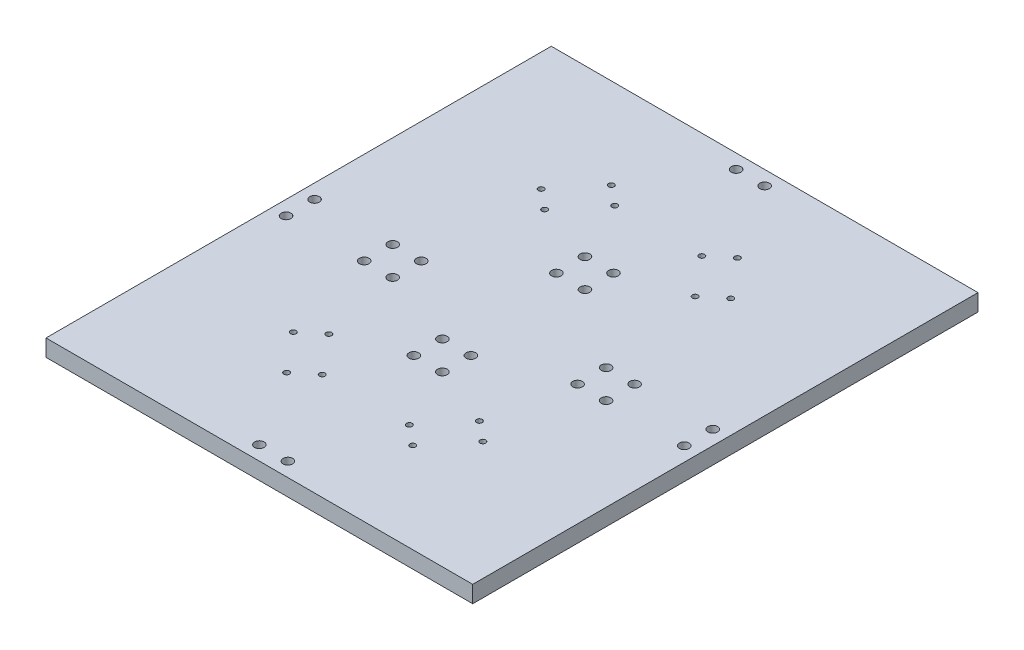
ISO-10303-21;
HEADER;
FILE_DESCRIPTION(('STEP AP214'),'2;1');
FILE_NAME('part.step','',(''),(''),'','','');
FILE_SCHEMA(('AUTOMOTIVE_DESIGN { 1 0 10303 214 1 1 1 1 }'));
ENDSEC;
DATA;
#1=APPLICATION_CONTEXT('core data for automotive mechanical design processes');
#2=APPLICATION_PROTOCOL_DEFINITION('international standard','automotive_design',2000,#1);
#3=PRODUCT_CONTEXT('',#1,'mechanical');
#4=PRODUCT('Part','Part','',(#3));
#5=PRODUCT_RELATED_PRODUCT_CATEGORY('part','',(#4));
#6=PRODUCT_DEFINITION_FORMATION('','',#4);
#7=PRODUCT_DEFINITION_CONTEXT('part definition',#1,'design');
#8=PRODUCT_DEFINITION('design','',#6,#7);
#9=PRODUCT_DEFINITION_SHAPE('','',#8);
#10=(LENGTH_UNIT() NAMED_UNIT(*) SI_UNIT(.MILLI.,.METRE.));
#11=(NAMED_UNIT(*) PLANE_ANGLE_UNIT() SI_UNIT($,.RADIAN.));
#12=(NAMED_UNIT(*) SI_UNIT($,.STERADIAN.) SOLID_ANGLE_UNIT());
#13=UNCERTAINTY_MEASURE_WITH_UNIT(LENGTH_MEASURE(1.E-05),#10,'distance_accuracy_value','');
#14=(GEOMETRIC_REPRESENTATION_CONTEXT(3) GLOBAL_UNCERTAINTY_ASSIGNED_CONTEXT((#13)) GLOBAL_UNIT_ASSIGNED_CONTEXT((#10,
#11,#12)) REPRESENTATION_CONTEXT('',''));
#15=CARTESIAN_POINT('',(0.,0.,0.));
#16=DIRECTION('',(0.,0.,1.));
#17=DIRECTION('',(1.,0.,0.));
#18=AXIS2_PLACEMENT_3D('',#15,#16,#17);
#19=CARTESIAN_POINT('',(0.,12.,0.));
#20=DIRECTION('',(0.,1.,0.));
#21=DIRECTION('',(0.,0.,1.));
#22=AXIS2_PLACEMENT_3D('',#19,#20,#21);
#23=PLANE('',#22);
#24=CARTESIAN_POINT('',(10.16,12.,39.456));
#25=DIRECTION('',(0.,1.,0.));
#26=DIRECTION('',(0.,0.,-1.));
#27=AXIS2_PLACEMENT_3D('',#24,#25,#26);
#28=CIRCLE('',#27,3.429);
#29=CARTESIAN_POINT('',(10.16,12.,36.027));
#30=VERTEX_POINT('',#29);
#31=EDGE_CURVE('E417',#30,#30,#28,.T.);
#32=ORIENTED_EDGE('',*,*,#31,.F.);
#33=EDGE_LOOP('',(#32));
#34=FACE_BOUND('',#33,.T.);
#35=CARTESIAN_POINT('',(-10.16,12.,-41.824));
#36=DIRECTION('',(0.,1.,0.));
#37=DIRECTION('',(0.,0.,1.));
#38=AXIS2_PLACEMENT_3D('',#35,#36,#37);
#39=CIRCLE('',#38,3.429);
#40=CARTESIAN_POINT('',(-10.16,12.,-38.395));
#41=VERTEX_POINT('',#40);
#42=EDGE_CURVE('E410',#41,#41,#39,.T.);
#43=ORIENTED_EDGE('',*,*,#42,.F.);
#44=EDGE_LOOP('',(#43));
#45=FACE_BOUND('',#44,.T.);
#46=CARTESIAN_POINT('',(10.16,12.,-41.824));
#47=DIRECTION('',(0.,1.,0.));
#48=DIRECTION('',(0.,0.,1.));
#49=AXIS2_PLACEMENT_3D('',#46,#47,#48);
#50=CIRCLE('',#49,3.429);
#51=CARTESIAN_POINT('',(10.16,12.,-38.395));
#52=VERTEX_POINT('',#51);
#53=EDGE_CURVE('E401',#52,#52,#50,.T.);
#54=ORIENTED_EDGE('',*,*,#53,.F.);
#55=EDGE_LOOP('',(#54));
#56=FACE_BOUND('',#55,.T.);
#57=CARTESIAN_POINT('',(10.16,12.,-62.144));
#58=DIRECTION('',(0.,1.,0.));
#59=DIRECTION('',(0.,0.,1.));
#60=AXIS2_PLACEMENT_3D('',#57,#58,#59);
#61=CIRCLE('',#60,3.429);
#62=CARTESIAN_POINT('',(10.16,12.,-58.715));
#63=VERTEX_POINT('',#62);
#64=EDGE_CURVE('E400',#63,#63,#61,.T.);
#65=ORIENTED_EDGE('',*,*,#64,.F.);
#66=EDGE_LOOP('',(#65));
#67=FACE_BOUND('',#66,.T.);
#68=CARTESIAN_POINT('',(-10.16,12.,59.776));
#69=DIRECTION('',(0.,1.,0.));
#70=DIRECTION('',(0.,0.,-1.));
#71=AXIS2_PLACEMENT_3D('',#68,#69,#70);
#72=CIRCLE('',#71,3.429);
#73=CARTESIAN_POINT('',(-10.16,12.,56.347));
#74=VERTEX_POINT('',#73);
#75=EDGE_CURVE('E442',#74,#74,#72,.T.);
#76=ORIENTED_EDGE('',*,*,#75,.F.);
#77=EDGE_LOOP('',(#76));
#78=FACE_BOUND('',#77,.T.);
#79=CARTESIAN_POINT('',(10.16,12.,59.776));
#80=DIRECTION('',(0.,1.,0.));
#81=DIRECTION('',(0.,0.,-1.));
#82=AXIS2_PLACEMENT_3D('',#79,#80,#81);
#83=CIRCLE('',#82,3.429);
#84=CARTESIAN_POINT('',(10.16,12.,56.347));
#85=VERTEX_POINT('',#84);
#86=EDGE_CURVE('E433',#85,#85,#83,.T.);
#87=ORIENTED_EDGE('',*,*,#86,.F.);
#88=EDGE_LOOP('',(#87));
#89=FACE_BOUND('',#88,.T.);
#90=CARTESIAN_POINT('',(-10.16,12.,39.456));
#91=DIRECTION('',(0.,1.,0.));
#92=DIRECTION('',(0.,0.,-1.));
#93=AXIS2_PLACEMENT_3D('',#90,#91,#92);
#94=CIRCLE('',#93,3.429);
#95=CARTESIAN_POINT('',(-10.16,12.,36.027));
#96=VERTEX_POINT('',#95);
#97=EDGE_CURVE('E426',#96,#96,#94,.T.);
#98=ORIENTED_EDGE('',*,*,#97,.F.);
#99=EDGE_LOOP('',(#98));
#100=FACE_BOUND('',#99,.T.);
#101=CARTESIAN_POINT('',(-10.16,12.,-62.144));
#102=DIRECTION('',(0.,1.,0.));
#103=DIRECTION('',(0.,0.,1.));
#104=AXIS2_PLACEMENT_3D('',#101,#102,#103);
#105=CIRCLE('',#104,3.429);
#106=CARTESIAN_POINT('',(-10.16,12.,-58.715));
#107=VERTEX_POINT('',#106);
#108=EDGE_CURVE('E396',#107,#107,#105,.T.);
#109=ORIENTED_EDGE('',*,*,#108,.F.);
#110=EDGE_LOOP('',(#109));
#111=FACE_BOUND('',#110,.T.);
#112=CARTESIAN_POINT('',(-10.16,12.,169.84));
#113=DIRECTION('',(0.,1.,0.));
#114=DIRECTION('',(0.,0.,-1.));
#115=AXIS2_PLACEMENT_3D('',#112,#113,#114);
#116=CIRCLE('',#115,3.42899999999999);
#117=CARTESIAN_POINT('',(-10.16,12.,166.411));
#118=VERTEX_POINT('',#117);
#119=EDGE_CURVE('E369',#118,#118,#116,.T.);
#120=ORIENTED_EDGE('',*,*,#119,.F.);
#121=EDGE_LOOP('',(#120));
#122=FACE_BOUND('',#121,.T.);
#123=CARTESIAN_POINT('',(10.16,12.,169.84));
#124=DIRECTION('',(0.,1.,0.));
#125=DIRECTION('',(0.,0.,-1.));
#126=AXIS2_PLACEMENT_3D('',#123,#124,#125);
#127=CIRCLE('',#126,3.42899999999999);
#128=CARTESIAN_POINT('',(10.16,12.,166.411));
#129=VERTEX_POINT('',#128);
#130=EDGE_CURVE('E379',#129,#129,#127,.T.);
#131=ORIENTED_EDGE('',*,*,#130,.F.);
#132=EDGE_LOOP('',(#131));
#133=FACE_BOUND('',#132,.T.);
#134=CARTESIAN_POINT('',(10.16,12.,-169.84));
#135=DIRECTION('',(0.,1.,0.));
#136=DIRECTION('',(0.,0.,1.));
#137=AXIS2_PLACEMENT_3D('',#134,#135,#136);
#138=CIRCLE('',#137,3.42899999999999);
#139=CARTESIAN_POINT('',(10.16,12.,-166.411));
#140=VERTEX_POINT('',#139);
#141=EDGE_CURVE('E368',#140,#140,#138,.T.);
#142=ORIENTED_EDGE('',*,*,#141,.F.);
#143=EDGE_LOOP('',(#142));
#144=FACE_BOUND('',#143,.T.);
#145=CARTESIAN_POINT('',(-10.16,12.,-169.84));
#146=DIRECTION('',(0.,1.,0.));
#147=DIRECTION('',(0.,0.,1.));
#148=AXIS2_PLACEMENT_3D('',#145,#146,#147);
#149=CIRCLE('',#148,3.42899999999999);
#150=CARTESIAN_POINT('',(-10.16,12.,-166.411));
#151=VERTEX_POINT('',#150);
#152=EDGE_CURVE('E364',#151,#151,#149,.T.);
#153=ORIENTED_EDGE('',*,*,#152,.F.);
#154=EDGE_LOOP('',(#153));
#155=FACE_BOUND('',#154,.T.);
#156=CARTESIAN_POINT('',(-141.859,12.,-1.18399999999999));
#157=DIRECTION('',(0.,1.,0.));
#158=DIRECTION('',(0.,0.,1.));
#159=AXIS2_PLACEMENT_3D('',#156,#157,#158);
#160=CIRCLE('',#159,3.429);
#161=CARTESIAN_POINT('',(-141.859,12.,2.24500000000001));
#162=VERTEX_POINT('',#161);
#163=EDGE_CURVE('E336',#162,#162,#160,.T.);
#164=ORIENTED_EDGE('',*,*,#163,.F.);
#165=EDGE_LOOP('',(#164));
#166=FACE_BOUND('',#165,.T.);
#167=CARTESIAN_POINT('',(141.859,12.,19.136));
#168=DIRECTION('',(0.,1.,0.));
#169=DIRECTION('',(0.,0.,-1.));
#170=AXIS2_PLACEMENT_3D('',#167,#168,#169);
#171=CIRCLE('',#170,3.429);
#172=CARTESIAN_POINT('',(141.859,12.,15.707));
#173=VERTEX_POINT('',#172);
#174=EDGE_CURVE('E337',#173,#173,#171,.T.);
#175=ORIENTED_EDGE('',*,*,#174,.F.);
#176=EDGE_LOOP('',(#175));
#177=FACE_BOUND('',#176,.T.);
#178=CARTESIAN_POINT('',(141.859,12.,-1.18399999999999));
#179=DIRECTION('',(0.,1.,0.));
#180=DIRECTION('',(0.,0.,-1.));
#181=AXIS2_PLACEMENT_3D('',#178,#179,#180);
#182=CIRCLE('',#181,3.429);
#183=CARTESIAN_POINT('',(141.859,12.,-4.61299999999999));
#184=VERTEX_POINT('',#183);
#185=EDGE_CURVE('E346',#184,#184,#182,.T.);
#186=ORIENTED_EDGE('',*,*,#185,.F.);
#187=EDGE_LOOP('',(#186));
#188=FACE_BOUND('',#187,.T.);
#189=CARTESIAN_POINT('',(-141.859,12.,19.136));
#190=DIRECTION('',(0.,1.,0.));
#191=DIRECTION('',(0.,0.,1.));
#192=AXIS2_PLACEMENT_3D('',#189,#190,#191);
#193=CIRCLE('',#192,3.429);
#194=CARTESIAN_POINT('',(-141.859,12.,22.565));
#195=VERTEX_POINT('',#194);
#196=EDGE_CURVE('E332',#195,#195,#193,.T.);
#197=ORIENTED_EDGE('',*,*,#196,.F.);
#198=EDGE_LOOP('',(#197));
#199=FACE_BOUND('',#198,.T.);
#200=CARTESIAN_POINT('',(65.8495,12.,-1.18399999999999));
#201=DIRECTION('',(0.,1.,0.));
#202=DIRECTION('',(0.,0.,-1.));
#203=AXIS2_PLACEMENT_3D('',#200,#201,#202);
#204=CIRCLE('',#203,3.429);
#205=CARTESIAN_POINT('',(65.8495,12.,-4.61299999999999));
#206=VERTEX_POINT('',#205);
#207=EDGE_CURVE('E289',#206,#206,#204,.T.);
#208=ORIENTED_EDGE('',*,*,#207,.F.);
#209=EDGE_LOOP('',(#208));
#210=FACE_BOUND('',#209,.T.);
#211=CARTESIAN_POINT('',(-65.8495,12.,19.136));
#212=DIRECTION('',(0.,1.,0.));
#213=DIRECTION('',(0.,0.,1.));
#214=AXIS2_PLACEMENT_3D('',#211,#212,#213);
#215=CIRCLE('',#214,3.429);
#216=CARTESIAN_POINT('',(-65.8495,12.,22.565));
#217=VERTEX_POINT('',#216);
#218=EDGE_CURVE('E282',#217,#217,#215,.T.);
#219=ORIENTED_EDGE('',*,*,#218,.F.);
#220=EDGE_LOOP('',(#219));
#221=FACE_BOUND('',#220,.T.);
#222=CARTESIAN_POINT('',(-86.1695,12.,19.136));
#223=DIRECTION('',(0.,1.,0.));
#224=DIRECTION('',(0.,0.,1.));
#225=AXIS2_PLACEMENT_3D('',#222,#223,#224);
#226=CIRCLE('',#225,3.429);
#227=CARTESIAN_POINT('',(-86.1695,12.,22.565));
#228=VERTEX_POINT('',#227);
#229=EDGE_CURVE('E273',#228,#228,#226,.T.);
#230=ORIENTED_EDGE('',*,*,#229,.F.);
#231=EDGE_LOOP('',(#230));
#232=FACE_BOUND('',#231,.T.);
#233=CARTESIAN_POINT('',(-65.8495,12.,-1.18399999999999));
#234=DIRECTION('',(0.,1.,0.));
#235=DIRECTION('',(0.,0.,1.));
#236=AXIS2_PLACEMENT_3D('',#233,#234,#235);
#237=CIRCLE('',#236,3.429);
#238=CARTESIAN_POINT('',(-65.8495,12.,2.24500000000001));
#239=VERTEX_POINT('',#238);
#240=EDGE_CURVE('E272',#239,#239,#237,.T.);
#241=ORIENTED_EDGE('',*,*,#240,.F.);
#242=EDGE_LOOP('',(#241));
#243=FACE_BOUND('',#242,.T.);
#244=CARTESIAN_POINT('',(65.8495,12.,19.136));
#245=DIRECTION('',(0.,1.,0.));
#246=DIRECTION('',(0.,0.,-1.));
#247=AXIS2_PLACEMENT_3D('',#244,#245,#246);
#248=CIRCLE('',#247,3.429);
#249=CARTESIAN_POINT('',(65.8495,12.,15.707));
#250=VERTEX_POINT('',#249);
#251=EDGE_CURVE('E298',#250,#250,#248,.T.);
#252=ORIENTED_EDGE('',*,*,#251,.F.);
#253=EDGE_LOOP('',(#252));
#254=FACE_BOUND('',#253,.T.);
#255=CARTESIAN_POINT('',(86.1695,12.,19.136));
#256=DIRECTION('',(0.,1.,0.));
#257=DIRECTION('',(0.,0.,-1.));
#258=AXIS2_PLACEMENT_3D('',#255,#256,#257);
#259=CIRCLE('',#258,3.429);
#260=CARTESIAN_POINT('',(86.1695,12.,15.707));
#261=VERTEX_POINT('',#260);
#262=EDGE_CURVE('E315',#261,#261,#259,.T.);
#263=ORIENTED_EDGE('',*,*,#262,.F.);
#264=EDGE_LOOP('',(#263));
#265=FACE_BOUND('',#264,.T.);
#266=CARTESIAN_POINT('',(86.1695,12.,-1.18399999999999));
#267=DIRECTION('',(0.,1.,0.));
#268=DIRECTION('',(0.,0.,-1.));
#269=AXIS2_PLACEMENT_3D('',#266,#267,#268);
#270=CIRCLE('',#269,3.429);
#271=CARTESIAN_POINT('',(86.1695,12.,-4.61299999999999));
#272=VERTEX_POINT('',#271);
#273=EDGE_CURVE('E305',#272,#272,#270,.T.);
#274=ORIENTED_EDGE('',*,*,#273,.F.);
#275=EDGE_LOOP('',(#274));
#276=FACE_BOUND('',#275,.T.);
#277=CARTESIAN_POINT('',(-86.1695,12.,-1.18399999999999));
#278=DIRECTION('',(0.,1.,0.));
#279=DIRECTION('',(0.,0.,1.));
#280=AXIS2_PLACEMENT_3D('',#277,#278,#279);
#281=CIRCLE('',#280,3.429);
#282=CARTESIAN_POINT('',(-86.1695,12.,2.24500000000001));
#283=VERTEX_POINT('',#282);
#284=EDGE_CURVE('E268',#283,#283,#281,.T.);
#285=ORIENTED_EDGE('',*,*,#284,.F.);
#286=EDGE_LOOP('',(#285));
#287=FACE_BOUND('',#286,.T.);
#288=CARTESIAN_POINT('',(31.0360206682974,12.,-104.2003199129));
#289=DIRECTION('',(0.,-1.,0.));
#290=DIRECTION('',(0.,0.,-1.));
#291=AXIS2_PLACEMENT_3D('',#288,#289,#290);
#292=CIRCLE('',#291,1.99999999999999);
#293=CARTESIAN_POINT('',(31.0360206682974,12.,-106.2003199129));
#294=VERTEX_POINT('',#293);
#295=EDGE_CURVE('E202',#294,#294,#292,.T.);
#296=ORIENTED_EDGE('',*,*,#295,.T.);
#297=EDGE_LOOP('',(#296));
#298=FACE_BOUND('',#297,.T.);
#299=CARTESIAN_POINT('',(44.9153772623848,12.,-115.661709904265));
#300=DIRECTION('',(0.,-1.,0.));
#301=DIRECTION('',(0.,0.,-1.));
#302=AXIS2_PLACEMENT_3D('',#299,#300,#301);
#303=CIRCLE('',#302,1.99999999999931);
#304=CARTESIAN_POINT('',(44.9153772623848,12.,-117.661709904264));
#305=VERTEX_POINT('',#304);
#306=EDGE_CURVE('E191',#305,#305,#303,.T.);
#307=ORIENTED_EDGE('',*,*,#306,.T.);
#308=EDGE_LOOP('',(#307));
#309=FACE_BOUND('',#308,.T.);
#310=CARTESIAN_POINT('',(53.6404261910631,12.,76.8271423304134));
#311=DIRECTION('',(0.,-1.,0.));
#312=DIRECTION('',(0.,0.,-1.));
#313=AXIS2_PLACEMENT_3D('',#310,#311,#312);
#314=CIRCLE('',#313,1.99999999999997);
#315=CARTESIAN_POINT('',(53.6404261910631,12.,74.8271423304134));
#316=VERTEX_POINT('',#315);
#317=EDGE_CURVE('E163',#316,#316,#314,.T.);
#318=ORIENTED_EDGE('',*,*,#317,.T.);
#319=EDGE_LOOP('',(#318));
#320=FACE_BOUND('',#319,.T.);
#321=CARTESIAN_POINT('',(67.5197827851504,12.,88.2885323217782));
#322=DIRECTION('',(0.,-1.,0.));
#323=DIRECTION('',(0.,0.,-1.));
#324=AXIS2_PLACEMENT_3D('',#321,#322,#323);
#325=CIRCLE('',#324,2.00000000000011);
#326=CARTESIAN_POINT('',(67.5197827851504,12.,86.2885323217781));
#327=VERTEX_POINT('',#326);
#328=EDGE_CURVE('E145',#327,#327,#325,.T.);
#329=ORIENTED_EDGE('',*,*,#328,.T.);
#330=EDGE_LOOP('',(#329));
#331=FACE_BOUND('',#330,.T.);
#332=CARTESIAN_POINT('',(-31.0360206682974,12.,104.2003199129));
#333=DIRECTION('',(0.,-1.,0.));
#334=DIRECTION('',(0.,0.,-1.));
#335=AXIS2_PLACEMENT_3D('',#332,#333,#334);
#336=CIRCLE('',#335,1.99999999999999);
#337=CARTESIAN_POINT('',(-31.0360206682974,12.,102.2003199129));
#338=VERTEX_POINT('',#337);
#339=EDGE_CURVE('E241',#338,#338,#336,.T.);
#340=ORIENTED_EDGE('',*,*,#339,.T.);
#341=EDGE_LOOP('',(#340));
#342=FACE_BOUND('',#341,.T.);
#343=CARTESIAN_POINT('',(-44.9153772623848,12.,115.661709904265));
#344=DIRECTION('',(0.,-1.,0.));
#345=DIRECTION('',(0.,0.,-1.));
#346=AXIS2_PLACEMENT_3D('',#343,#344,#345);
#347=CIRCLE('',#346,1.99999999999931);
#348=CARTESIAN_POINT('',(-44.9153772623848,12.,113.661709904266));
#349=VERTEX_POINT('',#348);
#350=EDGE_CURVE('E250',#349,#349,#347,.T.);
#351=ORIENTED_EDGE('',*,*,#350,.T.);
#352=EDGE_LOOP('',(#351));
#353=FACE_BOUND('',#352,.T.);
#354=CARTESIAN_POINT('',(-67.5197827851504,12.,-88.2885323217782));
#355=DIRECTION('',(0.,-1.,0.));
#356=DIRECTION('',(0.,0.,-1.));
#357=AXIS2_PLACEMENT_3D('',#354,#355,#356);
#358=CIRCLE('',#357,2.00000000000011);
#359=CARTESIAN_POINT('',(-67.5197827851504,12.,-90.2885323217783));
#360=VERTEX_POINT('',#359);
#361=EDGE_CURVE('E209',#360,#360,#358,.T.);
#362=ORIENTED_EDGE('',*,*,#361,.T.);
#363=EDGE_LOOP('',(#362));
#364=FACE_BOUND('',#363,.T.);
#365=CARTESIAN_POINT('',(-53.6404261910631,12.,-76.8271423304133));
#366=DIRECTION('',(0.,-1.,0.));
#367=DIRECTION('',(0.,0.,-1.));
#368=AXIS2_PLACEMENT_3D('',#365,#366,#367);
#369=CIRCLE('',#368,1.99999999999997);
#370=CARTESIAN_POINT('',(-53.6404261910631,12.,-78.8271423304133));
#371=VERTEX_POINT('',#370);
#372=EDGE_CURVE('E119',#371,#371,#369,.T.);
#373=ORIENTED_EDGE('',*,*,#372,.T.);
#374=EDGE_LOOP('',(#373));
#375=FACE_BOUND('',#374,.T.);
#376=DIRECTION('',(0.,0.,-1.));
#377=VECTOR('',#376,1.);
#378=CARTESIAN_POINT('',(152.019,12.,-180.));
#379=LINE('',#378,#377);
#380=CARTESIAN_POINT('',(152.019,12.,180.));
#381=VERTEX_POINT('',#380);
#382=CARTESIAN_POINT('',(152.019,12.,-180.));
#383=VERTEX_POINT('',#382);
#384=EDGE_CURVE('E97',#381,#383,#379,.T.);
#385=ORIENTED_EDGE('',*,*,#384,.T.);
#386=DIRECTION('',(-1.,0.,0.));
#387=VECTOR('',#386,1.);
#388=CARTESIAN_POINT('',(112.019,12.,-180.));
#389=LINE('',#388,#387);
#390=CARTESIAN_POINT('',(-152.019,12.,-180.));
#391=VERTEX_POINT('',#390);
#392=EDGE_CURVE('E92',#383,#391,#389,.T.);
#393=ORIENTED_EDGE('',*,*,#392,.T.);
#394=DIRECTION('',(0.,0.,1.));
#395=VECTOR('',#394,1.);
#396=CARTESIAN_POINT('',(-152.019,12.,-180.));
#397=LINE('',#396,#395);
#398=CARTESIAN_POINT('',(-152.019,12.,180.));
#399=VERTEX_POINT('',#398);
#400=EDGE_CURVE('E95',#391,#399,#397,.T.);
#401=ORIENTED_EDGE('',*,*,#400,.T.);
#402=DIRECTION('',(1.,0.,0.));
#403=VECTOR('',#402,1.);
#404=CARTESIAN_POINT('',(-152.019,12.,180.));
#405=LINE('',#404,#403);
#406=EDGE_CURVE('E66',#399,#381,#405,.T.);
#407=ORIENTED_EDGE('',*,*,#406,.T.);
#408=EDGE_LOOP('',(#385,#393,#401,#407));
#409=FACE_BOUND('',#408,.T.);
#410=CARTESIAN_POINT('',(44.9153772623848,12.,115.661709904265));
#411=DIRECTION('',(0.,1.,0.));
#412=DIRECTION('',(0.,0.,1.));
#413=AXIS2_PLACEMENT_3D('',#410,#411,#412);
#414=CIRCLE('',#413,1.99999999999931);
#415=CARTESIAN_POINT('',(44.9153772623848,12.,117.661709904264));
#416=VERTEX_POINT('',#415);
#417=EDGE_CURVE('E168',#416,#416,#414,.T.);
#418=ORIENTED_EDGE('',*,*,#417,.F.);
#419=EDGE_LOOP('',(#418));
#420=FACE_BOUND('',#419,.T.);
#421=CARTESIAN_POINT('',(-31.0360206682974,12.,-104.2003199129));
#422=DIRECTION('',(0.,1.,0.));
#423=DIRECTION('',(0.,0.,1.));
#424=AXIS2_PLACEMENT_3D('',#421,#422,#423);
#425=CIRCLE('',#424,1.99999999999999);
#426=CARTESIAN_POINT('',(-31.0360206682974,12.,-102.2003199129));
#427=VERTEX_POINT('',#426);
#428=EDGE_CURVE('E227',#427,#427,#425,.T.);
#429=ORIENTED_EDGE('',*,*,#428,.F.);
#430=EDGE_LOOP('',(#429));
#431=FACE_BOUND('',#430,.T.);
#432=CARTESIAN_POINT('',(-44.9153772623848,12.,-115.661709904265));
#433=DIRECTION('',(0.,1.,0.));
#434=DIRECTION('',(0.,0.,1.));
#435=AXIS2_PLACEMENT_3D('',#432,#433,#434);
#436=CIRCLE('',#435,1.99999999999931);
#437=CARTESIAN_POINT('',(-44.9153772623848,12.,-113.661709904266));
#438=VERTEX_POINT('',#437);
#439=EDGE_CURVE('E219',#438,#438,#436,.T.);
#440=ORIENTED_EDGE('',*,*,#439,.F.);
#441=EDGE_LOOP('',(#440));
#442=FACE_BOUND('',#441,.T.);
#443=CARTESIAN_POINT('',(-67.5197827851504,12.,88.2885323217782));
#444=DIRECTION('',(0.,1.,0.));
#445=DIRECTION('',(0.,0.,1.));
#446=AXIS2_PLACEMENT_3D('',#443,#444,#445);
#447=CIRCLE('',#446,2.00000000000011);
#448=CARTESIAN_POINT('',(-67.5197827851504,12.,90.2885323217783));
#449=VERTEX_POINT('',#448);
#450=EDGE_CURVE('E214',#449,#449,#447,.T.);
#451=ORIENTED_EDGE('',*,*,#450,.F.);
#452=EDGE_LOOP('',(#451));
#453=FACE_BOUND('',#452,.T.);
#454=CARTESIAN_POINT('',(-53.6404261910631,12.,76.8271423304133));
#455=DIRECTION('',(0.,1.,0.));
#456=DIRECTION('',(0.,0.,1.));
#457=AXIS2_PLACEMENT_3D('',#454,#455,#456);
#458=CIRCLE('',#457,1.99999999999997);
#459=CARTESIAN_POINT('',(-53.6404261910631,12.,78.8271423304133));
#460=VERTEX_POINT('',#459);
#461=EDGE_CURVE('E155',#460,#460,#458,.T.);
#462=ORIENTED_EDGE('',*,*,#461,.F.);
#463=EDGE_LOOP('',(#462));
#464=FACE_BOUND('',#463,.T.);
#465=CARTESIAN_POINT('',(31.0360206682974,12.,104.2003199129));
#466=DIRECTION('',(0.,1.,0.));
#467=DIRECTION('',(0.,0.,1.));
#468=AXIS2_PLACEMENT_3D('',#465,#466,#467);
#469=CIRCLE('',#468,1.99999999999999);
#470=CARTESIAN_POINT('',(31.0360206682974,12.,106.2003199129));
#471=VERTEX_POINT('',#470);
#472=EDGE_CURVE('E150',#471,#471,#469,.T.);
#473=ORIENTED_EDGE('',*,*,#472,.F.);
#474=EDGE_LOOP('',(#473));
#475=FACE_BOUND('',#474,.T.);
#476=CARTESIAN_POINT('',(67.5197827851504,12.,-88.2885323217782));
#477=DIRECTION('',(0.,1.,0.));
#478=DIRECTION('',(0.,0.,1.));
#479=AXIS2_PLACEMENT_3D('',#476,#477,#478);
#480=CIRCLE('',#479,2.00000000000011);
#481=CARTESIAN_POINT('',(67.5197827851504,12.,-86.2885323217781));
#482=VERTEX_POINT('',#481);
#483=EDGE_CURVE('E179',#482,#482,#480,.T.);
#484=ORIENTED_EDGE('',*,*,#483,.F.);
#485=EDGE_LOOP('',(#484));
#486=FACE_BOUND('',#485,.T.);
#487=CARTESIAN_POINT('',(53.6404261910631,12.,-76.8271423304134));
#488=DIRECTION('',(0.,1.,0.));
#489=DIRECTION('',(0.,0.,1.));
#490=AXIS2_PLACEMENT_3D('',#487,#488,#489);
#491=CIRCLE('',#490,1.99999999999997);
#492=CARTESIAN_POINT('',(53.6404261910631,12.,-74.8271423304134));
#493=VERTEX_POINT('',#492);
#494=EDGE_CURVE('E187',#493,#493,#491,.T.);
#495=ORIENTED_EDGE('',*,*,#494,.F.);
#496=EDGE_LOOP('',(#495));
#497=FACE_BOUND('',#496,.T.);
#498=ADVANCED_FACE('F48',(#34,#45,#56,#67,#78,#89,#100,#111,#122,#133,#144,#155,#166,#177,#188,
#199,#210,#221,#232,#243,#254,#265,#276,#287,#298,#309,#320,#331,#342,#353,#364,#375,#409,#420,
#431,#442,#453,#464,#475,#486,#497),#23,.T.);
#499=CARTESIAN_POINT('',(0.,0.,0.));
#500=DIRECTION('',(0.,1.,0.));
#501=DIRECTION('',(0.,0.,1.));
#502=AXIS2_PLACEMENT_3D('',#499,#500,#501);
#503=PLANE('',#502);
#504=CARTESIAN_POINT('',(10.16,0.,39.456));
#505=DIRECTION('',(0.,1.,0.));
#506=DIRECTION('',(0.,0.,1.));
#507=AXIS2_PLACEMENT_3D('',#504,#505,#506);
#508=CIRCLE('',#507,3.429);
#509=CARTESIAN_POINT('',(10.16,0.,42.885));
#510=VERTEX_POINT('',#509);
#511=EDGE_CURVE('E422',#510,#510,#508,.F.);
#512=ORIENTED_EDGE('',*,*,#511,.F.);
#513=EDGE_LOOP('',(#512));
#514=FACE_BOUND('',#513,.T.);
#515=CARTESIAN_POINT('',(-10.16,0.,-41.824));
#516=DIRECTION('',(0.,1.,0.));
#517=DIRECTION('',(0.,0.,1.));
#518=AXIS2_PLACEMENT_3D('',#515,#516,#517);
#519=CIRCLE('',#518,3.429);
#520=CARTESIAN_POINT('',(-10.16,0.,-38.395));
#521=VERTEX_POINT('',#520);
#522=EDGE_CURVE('E421',#521,#521,#519,.F.);
#523=ORIENTED_EDGE('',*,*,#522,.F.);
#524=EDGE_LOOP('',(#523));
#525=FACE_BOUND('',#524,.T.);
#526=CARTESIAN_POINT('',(10.16,0.,-41.824));
#527=DIRECTION('',(0.,1.,0.));
#528=DIRECTION('',(0.,0.,1.));
#529=AXIS2_PLACEMENT_3D('',#526,#527,#528);
#530=CIRCLE('',#529,3.429);
#531=CARTESIAN_POINT('',(10.16,0.,-38.395));
#532=VERTEX_POINT('',#531);
#533=EDGE_CURVE('E406',#532,#532,#530,.F.);
#534=ORIENTED_EDGE('',*,*,#533,.F.);
#535=EDGE_LOOP('',(#534));
#536=FACE_BOUND('',#535,.T.);
#537=CARTESIAN_POINT('',(10.16,0.,-62.144));
#538=DIRECTION('',(0.,1.,0.));
#539=DIRECTION('',(0.,0.,1.));
#540=AXIS2_PLACEMENT_3D('',#537,#538,#539);
#541=CIRCLE('',#540,3.429);
#542=CARTESIAN_POINT('',(10.16,0.,-58.715));
#543=VERTEX_POINT('',#542);
#544=EDGE_CURVE('E405',#543,#543,#541,.F.);
#545=ORIENTED_EDGE('',*,*,#544,.F.);
#546=EDGE_LOOP('',(#545));
#547=FACE_BOUND('',#546,.T.);
#548=CARTESIAN_POINT('',(-10.16,0.,59.776));
#549=DIRECTION('',(0.,1.,0.));
#550=DIRECTION('',(0.,0.,1.));
#551=AXIS2_PLACEMENT_3D('',#548,#549,#550);
#552=CIRCLE('',#551,3.429);
#553=CARTESIAN_POINT('',(-10.16,0.,63.205));
#554=VERTEX_POINT('',#553);
#555=EDGE_CURVE('E452',#554,#554,#552,.F.);
#556=ORIENTED_EDGE('',*,*,#555,.F.);
#557=EDGE_LOOP('',(#556));
#558=FACE_BOUND('',#557,.T.);
#559=CARTESIAN_POINT('',(10.16,0.,59.776));
#560=DIRECTION('',(0.,1.,0.));
#561=DIRECTION('',(0.,0.,1.));
#562=AXIS2_PLACEMENT_3D('',#559,#560,#561);
#563=CIRCLE('',#562,3.429);
#564=CARTESIAN_POINT('',(10.16,0.,63.205));
#565=VERTEX_POINT('',#564);
#566=EDGE_CURVE('E438',#565,#565,#563,.F.);
#567=ORIENTED_EDGE('',*,*,#566,.F.);
#568=EDGE_LOOP('',(#567));
#569=FACE_BOUND('',#568,.T.);
#570=CARTESIAN_POINT('',(-10.16,0.,39.456));
#571=DIRECTION('',(0.,1.,0.));
#572=DIRECTION('',(0.,0.,1.));
#573=AXIS2_PLACEMENT_3D('',#570,#571,#572);
#574=CIRCLE('',#573,3.429);
#575=CARTESIAN_POINT('',(-10.16,0.,42.885));
#576=VERTEX_POINT('',#575);
#577=EDGE_CURVE('E437',#576,#576,#574,.F.);
#578=ORIENTED_EDGE('',*,*,#577,.F.);
#579=EDGE_LOOP('',(#578));
#580=FACE_BOUND('',#579,.T.);
#581=CARTESIAN_POINT('',(-10.16,0.,-62.144));
#582=DIRECTION('',(0.,1.,0.));
#583=DIRECTION('',(0.,0.,1.));
#584=AXIS2_PLACEMENT_3D('',#581,#582,#583);
#585=CIRCLE('',#584,3.429);
#586=CARTESIAN_POINT('',(-10.16,0.,-58.715));
#587=VERTEX_POINT('',#586);
#588=EDGE_CURVE('E378',#587,#587,#585,.F.);
#589=ORIENTED_EDGE('',*,*,#588,.F.);
#590=EDGE_LOOP('',(#589));
#591=FACE_BOUND('',#590,.T.);
#592=CARTESIAN_POINT('',(-10.16,0.,169.84));
#593=DIRECTION('',(0.,1.,0.));
#594=DIRECTION('',(0.,0.,1.));
#595=AXIS2_PLACEMENT_3D('',#592,#593,#594);
#596=CIRCLE('',#595,3.42899999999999);
#597=CARTESIAN_POINT('',(-10.16,0.,173.269));
#598=VERTEX_POINT('',#597);
#599=EDGE_CURVE('E374',#598,#598,#596,.F.);
#600=ORIENTED_EDGE('',*,*,#599,.F.);
#601=EDGE_LOOP('',(#600));
#602=FACE_BOUND('',#601,.T.);
#603=CARTESIAN_POINT('',(10.16,0.,169.84));
#604=DIRECTION('',(0.,1.,0.));
#605=DIRECTION('',(0.,0.,1.));
#606=AXIS2_PLACEMENT_3D('',#603,#604,#605);
#607=CIRCLE('',#606,3.42899999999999);
#608=CARTESIAN_POINT('',(10.16,0.,173.269));
#609=VERTEX_POINT('',#608);
#610=EDGE_CURVE('E373',#609,#609,#607,.F.);
#611=ORIENTED_EDGE('',*,*,#610,.F.);
#612=EDGE_LOOP('',(#611));
#613=FACE_BOUND('',#612,.T.);
#614=CARTESIAN_POINT('',(10.16,0.,-169.84));
#615=DIRECTION('',(0.,1.,0.));
#616=DIRECTION('',(0.,0.,1.));
#617=AXIS2_PLACEMENT_3D('',#614,#615,#616);
#618=CIRCLE('',#617,3.42899999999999);
#619=CARTESIAN_POINT('',(10.16,0.,-166.411));
#620=VERTEX_POINT('',#619);
#621=EDGE_CURVE('E383',#620,#620,#618,.F.);
#622=ORIENTED_EDGE('',*,*,#621,.F.);
#623=EDGE_LOOP('',(#622));
#624=FACE_BOUND('',#623,.T.);
#625=CARTESIAN_POINT('',(-10.16,0.,-169.84));
#626=DIRECTION('',(0.,1.,0.));
#627=DIRECTION('',(0.,0.,1.));
#628=AXIS2_PLACEMENT_3D('',#625,#626,#627);
#629=CIRCLE('',#628,3.42899999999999);
#630=CARTESIAN_POINT('',(-10.16,0.,-166.411));
#631=VERTEX_POINT('',#630);
#632=EDGE_CURVE('E360',#631,#631,#629,.F.);
#633=ORIENTED_EDGE('',*,*,#632,.F.);
#634=EDGE_LOOP('',(#633));
#635=FACE_BOUND('',#634,.T.);
#636=CARTESIAN_POINT('',(-141.859,0.,-1.18399999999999));
#637=DIRECTION('',(0.,1.,0.));
#638=DIRECTION('',(0.,0.,1.));
#639=AXIS2_PLACEMENT_3D('',#636,#637,#638);
#640=CIRCLE('',#639,3.429);
#641=CARTESIAN_POINT('',(-141.859,0.,2.24500000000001));
#642=VERTEX_POINT('',#641);
#643=EDGE_CURVE('E341',#642,#642,#640,.F.);
#644=ORIENTED_EDGE('',*,*,#643,.F.);
#645=EDGE_LOOP('',(#644));
#646=FACE_BOUND('',#645,.T.);
#647=CARTESIAN_POINT('',(141.859,0.,19.136));
#648=DIRECTION('',(0.,1.,0.));
#649=DIRECTION('',(0.,0.,1.));
#650=AXIS2_PLACEMENT_3D('',#647,#648,#649);
#651=CIRCLE('',#650,3.429);
#652=CARTESIAN_POINT('',(141.859,0.,22.565));
#653=VERTEX_POINT('',#652);
#654=EDGE_CURVE('E342',#653,#653,#651,.F.);
#655=ORIENTED_EDGE('',*,*,#654,.F.);
#656=EDGE_LOOP('',(#655));
#657=FACE_BOUND('',#656,.T.);
#658=CARTESIAN_POINT('',(141.859,0.,-1.18399999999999));
#659=DIRECTION('',(0.,1.,0.));
#660=DIRECTION('',(0.,0.,1.));
#661=AXIS2_PLACEMENT_3D('',#658,#659,#660);
#662=CIRCLE('',#661,3.429);
#663=CARTESIAN_POINT('',(141.859,0.,2.24500000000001));
#664=VERTEX_POINT('',#663);
#665=EDGE_CURVE('E356',#664,#664,#662,.F.);
#666=ORIENTED_EDGE('',*,*,#665,.F.);
#667=EDGE_LOOP('',(#666));
#668=FACE_BOUND('',#667,.T.);
#669=CARTESIAN_POINT('',(-141.859,0.,19.136));
#670=DIRECTION('',(0.,1.,0.));
#671=DIRECTION('',(0.,0.,1.));
#672=AXIS2_PLACEMENT_3D('',#669,#670,#671);
#673=CIRCLE('',#672,3.429);
#674=CARTESIAN_POINT('',(-141.859,0.,22.565));
#675=VERTEX_POINT('',#674);
#676=EDGE_CURVE('E314',#675,#675,#673,.F.);
#677=ORIENTED_EDGE('',*,*,#676,.F.);
#678=EDGE_LOOP('',(#677));
#679=FACE_BOUND('',#678,.T.);
#680=CARTESIAN_POINT('',(65.8495,0.,-1.18399999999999));
#681=DIRECTION('',(0.,1.,0.));
#682=DIRECTION('',(0.,0.,1.));
#683=AXIS2_PLACEMENT_3D('',#680,#681,#682);
#684=CIRCLE('',#683,3.429);
#685=CARTESIAN_POINT('',(65.8495,0.,2.24500000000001));
#686=VERTEX_POINT('',#685);
#687=EDGE_CURVE('E294',#686,#686,#684,.F.);
#688=ORIENTED_EDGE('',*,*,#687,.F.);
#689=EDGE_LOOP('',(#688));
#690=FACE_BOUND('',#689,.T.);
#691=CARTESIAN_POINT('',(-65.8495,0.,19.136));
#692=DIRECTION('',(0.,1.,0.));
#693=DIRECTION('',(0.,0.,1.));
#694=AXIS2_PLACEMENT_3D('',#691,#692,#693);
#695=CIRCLE('',#694,3.429);
#696=CARTESIAN_POINT('',(-65.8495,0.,22.565));
#697=VERTEX_POINT('',#696);
#698=EDGE_CURVE('E293',#697,#697,#695,.F.);
#699=ORIENTED_EDGE('',*,*,#698,.F.);
#700=EDGE_LOOP('',(#699));
#701=FACE_BOUND('',#700,.T.);
#702=CARTESIAN_POINT('',(-86.1695,0.,19.136));
#703=DIRECTION('',(0.,1.,0.));
#704=DIRECTION('',(0.,0.,1.));
#705=AXIS2_PLACEMENT_3D('',#702,#703,#704);
#706=CIRCLE('',#705,3.429);
#707=CARTESIAN_POINT('',(-86.1695,0.,22.565));
#708=VERTEX_POINT('',#707);
#709=EDGE_CURVE('E278',#708,#708,#706,.F.);
#710=ORIENTED_EDGE('',*,*,#709,.F.);
#711=EDGE_LOOP('',(#710));
#712=FACE_BOUND('',#711,.T.);
#713=CARTESIAN_POINT('',(-65.8495,0.,-1.18399999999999));
#714=DIRECTION('',(0.,1.,0.));
#715=DIRECTION('',(0.,0.,1.));
#716=AXIS2_PLACEMENT_3D('',#713,#714,#715);
#717=CIRCLE('',#716,3.429);
#718=CARTESIAN_POINT('',(-65.8495,0.,2.24500000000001));
#719=VERTEX_POINT('',#718);
#720=EDGE_CURVE('E277',#719,#719,#717,.F.);
#721=ORIENTED_EDGE('',*,*,#720,.F.);
#722=EDGE_LOOP('',(#721));
#723=FACE_BOUND('',#722,.T.);
#724=CARTESIAN_POINT('',(65.8495,0.,19.136));
#725=DIRECTION('',(0.,1.,0.));
#726=DIRECTION('',(0.,0.,1.));
#727=AXIS2_PLACEMENT_3D('',#724,#725,#726);
#728=CIRCLE('',#727,3.429);
#729=CARTESIAN_POINT('',(65.8495,0.,22.565));
#730=VERTEX_POINT('',#729);
#731=EDGE_CURVE('E319',#730,#730,#728,.F.);
#732=ORIENTED_EDGE('',*,*,#731,.F.);
#733=EDGE_LOOP('',(#732));
#734=FACE_BOUND('',#733,.T.);
#735=CARTESIAN_POINT('',(86.1695,0.,19.136));
#736=DIRECTION('',(0.,1.,0.));
#737=DIRECTION('',(0.,0.,1.));
#738=AXIS2_PLACEMENT_3D('',#735,#736,#737);
#739=CIRCLE('',#738,3.429);
#740=CARTESIAN_POINT('',(86.1695,0.,22.565));
#741=VERTEX_POINT('',#740);
#742=EDGE_CURVE('E309',#741,#741,#739,.F.);
#743=ORIENTED_EDGE('',*,*,#742,.F.);
#744=EDGE_LOOP('',(#743));
#745=FACE_BOUND('',#744,.T.);
#746=CARTESIAN_POINT('',(86.1695,0.,-1.18399999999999));
#747=DIRECTION('',(0.,1.,0.));
#748=DIRECTION('',(0.,0.,1.));
#749=AXIS2_PLACEMENT_3D('',#746,#747,#748);
#750=CIRCLE('',#749,3.429);
#751=CARTESIAN_POINT('',(86.1695,0.,2.24500000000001));
#752=VERTEX_POINT('',#751);
#753=EDGE_CURVE('E310',#752,#752,#750,.F.);
#754=ORIENTED_EDGE('',*,*,#753,.F.);
#755=EDGE_LOOP('',(#754));
#756=FACE_BOUND('',#755,.T.);
#757=CARTESIAN_POINT('',(-86.1695,0.,-1.18399999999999));
#758=DIRECTION('',(0.,1.,0.));
#759=DIRECTION('',(0.,0.,1.));
#760=AXIS2_PLACEMENT_3D('',#757,#758,#759);
#761=CIRCLE('',#760,3.429);
#762=CARTESIAN_POINT('',(-86.1695,0.,2.24500000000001));
#763=VERTEX_POINT('',#762);
#764=EDGE_CURVE('E246',#763,#763,#761,.F.);
#765=ORIENTED_EDGE('',*,*,#764,.F.);
#766=EDGE_LOOP('',(#765));
#767=FACE_BOUND('',#766,.T.);
#768=CARTESIAN_POINT('',(31.0360206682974,0.,-104.2003199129));
#769=DIRECTION('',(0.,1.,0.));
#770=DIRECTION('',(0.,0.,1.));
#771=AXIS2_PLACEMENT_3D('',#768,#769,#770);
#772=CIRCLE('',#771,1.99999999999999);
#773=CARTESIAN_POINT('',(31.0360206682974,0.,-102.2003199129));
#774=VERTEX_POINT('',#773);
#775=EDGE_CURVE('E141',#774,#774,#772,.T.);
#776=ORIENTED_EDGE('',*,*,#775,.T.);
#777=EDGE_LOOP('',(#776));
#778=FACE_BOUND('',#777,.T.);
#779=CARTESIAN_POINT('',(44.9153772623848,0.,-115.661709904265));
#780=DIRECTION('',(0.,1.,0.));
#781=DIRECTION('',(0.,0.,1.));
#782=AXIS2_PLACEMENT_3D('',#779,#780,#781);
#783=CIRCLE('',#782,1.99999999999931);
#784=CARTESIAN_POINT('',(44.9153772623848,0.,-113.661709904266));
#785=VERTEX_POINT('',#784);
#786=EDGE_CURVE('E198',#785,#785,#783,.T.);
#787=ORIENTED_EDGE('',*,*,#786,.T.);
#788=EDGE_LOOP('',(#787));
#789=FACE_BOUND('',#788,.T.);
#790=CARTESIAN_POINT('',(67.5197827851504,0.,-88.2885323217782));
#791=DIRECTION('',(0.,1.,0.));
#792=DIRECTION('',(0.,0.,1.));
#793=AXIS2_PLACEMENT_3D('',#790,#791,#792);
#794=CIRCLE('',#793,2.00000000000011);
#795=CARTESIAN_POINT('',(67.5197827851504,0.,-86.2885323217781));
#796=VERTEX_POINT('',#795);
#797=EDGE_CURVE('E159',#796,#796,#794,.F.);
#798=ORIENTED_EDGE('',*,*,#797,.F.);
#799=EDGE_LOOP('',(#798));
#800=FACE_BOUND('',#799,.T.);
#801=CARTESIAN_POINT('',(53.6404261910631,0.,76.8271423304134));
#802=DIRECTION('',(0.,1.,0.));
#803=DIRECTION('',(0.,0.,1.));
#804=AXIS2_PLACEMENT_3D('',#801,#802,#803);
#805=CIRCLE('',#804,1.99999999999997);
#806=CARTESIAN_POINT('',(53.6404261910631,0.,78.8271423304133));
#807=VERTEX_POINT('',#806);
#808=EDGE_CURVE('E167',#807,#807,#805,.T.);
#809=ORIENTED_EDGE('',*,*,#808,.T.);
#810=EDGE_LOOP('',(#809));
#811=FACE_BOUND('',#810,.T.);
#812=CARTESIAN_POINT('',(-53.6404261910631,0.,76.8271423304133));
#813=DIRECTION('',(0.,1.,0.));
#814=DIRECTION('',(0.,0.,1.));
#815=AXIS2_PLACEMENT_3D('',#812,#813,#814);
#816=CIRCLE('',#815,1.99999999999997);
#817=CARTESIAN_POINT('',(-53.6404261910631,0.,78.8271423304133));
#818=VERTEX_POINT('',#817);
#819=EDGE_CURVE('E154',#818,#818,#816,.F.);
#820=ORIENTED_EDGE('',*,*,#819,.F.);
#821=EDGE_LOOP('',(#820));
#822=FACE_BOUND('',#821,.T.);
#823=CARTESIAN_POINT('',(-31.0360206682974,0.,104.2003199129));
#824=DIRECTION('',(0.,1.,0.));
#825=DIRECTION('',(0.,0.,1.));
#826=AXIS2_PLACEMENT_3D('',#823,#824,#825);
#827=CIRCLE('',#826,1.99999999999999);
#828=CARTESIAN_POINT('',(-31.0360206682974,0.,106.2003199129));
#829=VERTEX_POINT('',#828);
#830=EDGE_CURVE('E245',#829,#829,#827,.T.);
#831=ORIENTED_EDGE('',*,*,#830,.T.);
#832=EDGE_LOOP('',(#831));
#833=FACE_BOUND('',#832,.T.);
#834=CARTESIAN_POINT('',(-44.9153772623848,0.,115.661709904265));
#835=DIRECTION('',(0.,1.,0.));
#836=DIRECTION('',(0.,0.,1.));
#837=AXIS2_PLACEMENT_3D('',#834,#835,#836);
#838=CIRCLE('',#837,1.99999999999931);
#839=CARTESIAN_POINT('',(-44.9153772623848,0.,117.661709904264));
#840=VERTEX_POINT('',#839);
#841=EDGE_CURVE('E254',#840,#840,#838,.T.);
#842=ORIENTED_EDGE('',*,*,#841,.T.);
#843=EDGE_LOOP('',(#842));
#844=FACE_BOUND('',#843,.T.);
#845=CARTESIAN_POINT('',(-44.9153772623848,0.,-115.661709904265));
#846=DIRECTION('',(0.,1.,0.));
#847=DIRECTION('',(0.,0.,1.));
#848=AXIS2_PLACEMENT_3D('',#845,#846,#847);
#849=CIRCLE('',#848,1.99999999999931);
#850=CARTESIAN_POINT('',(-44.9153772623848,0.,-113.661709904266));
#851=VERTEX_POINT('',#850);
#852=EDGE_CURVE('E218',#851,#851,#849,.F.);
#853=ORIENTED_EDGE('',*,*,#852,.F.);
#854=EDGE_LOOP('',(#853));
#855=FACE_BOUND('',#854,.T.);
#856=CARTESIAN_POINT('',(44.9153772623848,0.,115.661709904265));
#857=DIRECTION('',(0.,1.,0.));
#858=DIRECTION('',(0.,0.,1.));
#859=AXIS2_PLACEMENT_3D('',#856,#857,#858);
#860=CIRCLE('',#859,1.99999999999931);
#861=CARTESIAN_POINT('',(44.9153772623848,0.,117.661709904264));
#862=VERTEX_POINT('',#861);
#863=EDGE_CURVE('E231',#862,#862,#860,.F.);
#864=ORIENTED_EDGE('',*,*,#863,.F.);
#865=EDGE_LOOP('',(#864));
#866=FACE_BOUND('',#865,.T.);
#867=CARTESIAN_POINT('',(-53.6404261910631,0.,-76.8271423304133));
#868=DIRECTION('',(0.,1.,0.));
#869=DIRECTION('',(0.,0.,1.));
#870=AXIS2_PLACEMENT_3D('',#867,#868,#869);
#871=CIRCLE('',#870,1.99999999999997);
#872=CARTESIAN_POINT('',(-53.6404261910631,0.,-74.8271423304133));
#873=VERTEX_POINT('',#872);
#874=EDGE_CURVE('E137',#873,#873,#871,.T.);
#875=ORIENTED_EDGE('',*,*,#874,.T.);
#876=EDGE_LOOP('',(#875));
#877=FACE_BOUND('',#876,.T.);
#878=DIRECTION('',(-1.,0.,0.));
#879=VECTOR('',#878,1.);
#880=CARTESIAN_POINT('',(-112.019,0.,-180.));
#881=LINE('',#880,#879);
#882=CARTESIAN_POINT('',(152.019,0.,-180.));
#883=VERTEX_POINT('',#882);
#884=CARTESIAN_POINT('',(-152.019,0.,-180.));
#885=VERTEX_POINT('',#884);
#886=EDGE_CURVE('E103',#883,#885,#881,.T.);
#887=ORIENTED_EDGE('',*,*,#886,.F.);
#888=DIRECTION('',(0.,0.,-1.));
#889=VECTOR('',#888,1.);
#890=CARTESIAN_POINT('',(152.019,0.,140.));
#891=LINE('',#890,#889);
#892=CARTESIAN_POINT('',(152.019,0.,180.));
#893=VERTEX_POINT('',#892);
#894=EDGE_CURVE('E86',#893,#883,#891,.T.);
#895=ORIENTED_EDGE('',*,*,#894,.F.);
#896=DIRECTION('',(1.,0.,0.));
#897=VECTOR('',#896,1.);
#898=CARTESIAN_POINT('',(112.019,0.,180.));
#899=LINE('',#898,#897);
#900=CARTESIAN_POINT('',(-152.019,0.,180.));
#901=VERTEX_POINT('',#900);
#902=EDGE_CURVE('E82',#901,#893,#899,.T.);
#903=ORIENTED_EDGE('',*,*,#902,.F.);
#904=DIRECTION('',(0.,0.,1.));
#905=VECTOR('',#904,1.);
#906=CARTESIAN_POINT('',(-152.019,0.,140.));
#907=LINE('',#906,#905);
#908=EDGE_CURVE('E118',#885,#901,#907,.T.);
#909=ORIENTED_EDGE('',*,*,#908,.F.);
#910=EDGE_LOOP('',(#887,#895,#903,#909));
#911=FACE_BOUND('',#910,.T.);
#912=CARTESIAN_POINT('',(-31.0360206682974,0.,-104.2003199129));
#913=DIRECTION('',(0.,1.,0.));
#914=DIRECTION('',(0.,0.,1.));
#915=AXIS2_PLACEMENT_3D('',#912,#913,#914);
#916=CIRCLE('',#915,1.99999999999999);
#917=CARTESIAN_POINT('',(-31.0360206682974,0.,-102.2003199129));
#918=VERTEX_POINT('',#917);
#919=EDGE_CURVE('E223',#918,#918,#916,.F.);
#920=ORIENTED_EDGE('',*,*,#919,.F.);
#921=EDGE_LOOP('',(#920));
#922=FACE_BOUND('',#921,.T.);
#923=CARTESIAN_POINT('',(-67.5197827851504,0.,-88.2885323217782));
#924=DIRECTION('',(0.,1.,0.));
#925=DIRECTION('',(0.,0.,1.));
#926=AXIS2_PLACEMENT_3D('',#923,#924,#925);
#927=CIRCLE('',#926,2.00000000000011);
#928=CARTESIAN_POINT('',(-67.5197827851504,0.,-86.2885323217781));
#929=VERTEX_POINT('',#928);
#930=EDGE_CURVE('E213',#929,#929,#927,.T.);
#931=ORIENTED_EDGE('',*,*,#930,.T.);
#932=EDGE_LOOP('',(#931));
#933=FACE_BOUND('',#932,.T.);
#934=CARTESIAN_POINT('',(-67.5197827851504,0.,88.2885323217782));
#935=DIRECTION('',(0.,1.,0.));
#936=DIRECTION('',(0.,0.,1.));
#937=AXIS2_PLACEMENT_3D('',#934,#935,#936);
#938=CIRCLE('',#937,2.00000000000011);
#939=CARTESIAN_POINT('',(-67.5197827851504,0.,90.2885323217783));
#940=VERTEX_POINT('',#939);
#941=EDGE_CURVE('E258',#940,#940,#938,.F.);
#942=ORIENTED_EDGE('',*,*,#941,.F.);
#943=EDGE_LOOP('',(#942));
#944=FACE_BOUND('',#943,.T.);
#945=CARTESIAN_POINT('',(67.5197827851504,0.,88.2885323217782));
#946=DIRECTION('',(0.,1.,0.));
#947=DIRECTION('',(0.,0.,1.));
#948=AXIS2_PLACEMENT_3D('',#945,#946,#947);
#949=CIRCLE('',#948,2.00000000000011);
#950=CARTESIAN_POINT('',(67.5197827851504,0.,90.2885323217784));
#951=VERTEX_POINT('',#950);
#952=EDGE_CURVE('E149',#951,#951,#949,.T.);
#953=ORIENTED_EDGE('',*,*,#952,.T.);
#954=EDGE_LOOP('',(#953));
#955=FACE_BOUND('',#954,.T.);
#956=CARTESIAN_POINT('',(31.0360206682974,0.,104.2003199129));
#957=DIRECTION('',(0.,1.,0.));
#958=DIRECTION('',(0.,0.,1.));
#959=AXIS2_PLACEMENT_3D('',#956,#957,#958);
#960=CIRCLE('',#959,1.99999999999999);
#961=CARTESIAN_POINT('',(31.0360206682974,0.,106.2003199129));
#962=VERTEX_POINT('',#961);
#963=EDGE_CURVE('E172',#962,#962,#960,.F.);
#964=ORIENTED_EDGE('',*,*,#963,.F.);
#965=EDGE_LOOP('',(#964));
#966=FACE_BOUND('',#965,.T.);
#967=CARTESIAN_POINT('',(53.6404261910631,0.,-76.8271423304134));
#968=DIRECTION('',(0.,1.,0.));
#969=DIRECTION('',(0.,0.,1.));
#970=AXIS2_PLACEMENT_3D('',#967,#968,#969);
#971=CIRCLE('',#970,1.99999999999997);
#972=CARTESIAN_POINT('',(53.6404261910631,0.,-74.8271423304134));
#973=VERTEX_POINT('',#972);
#974=EDGE_CURVE('E183',#973,#973,#971,.F.);
#975=ORIENTED_EDGE('',*,*,#974,.F.);
#976=EDGE_LOOP('',(#975));
#977=FACE_BOUND('',#976,.T.);
#978=ADVANCED_FACE('F459',(#514,#525,#536,#547,#558,#569,#580,#591,#602,#613,#624,#635,#646,
#657,#668,#679,#690,#701,#712,#723,#734,#745,#756,#767,#778,#789,#800,#811,#822,#833,#844,#855,
#866,#877,#911,#922,#933,#944,#955,#966,#977),#503,.F.);
#979=CARTESIAN_POINT('',(-112.019,12.,-180.));
#980=DIRECTION('',(0.,0.,1.));
#981=DIRECTION('',(1.,0.,0.));
#982=AXIS2_PLACEMENT_3D('',#979,#980,#981);
#983=PLANE('',#982);
#984=ORIENTED_EDGE('',*,*,#886,.T.);
#985=DIRECTION('',(0.,-1.,0.));
#986=VECTOR('',#985,1.);
#987=CARTESIAN_POINT('',(-152.019,12.,-180.));
#988=LINE('',#987,#986);
#989=EDGE_CURVE('E58',#391,#885,#988,.T.);
#990=ORIENTED_EDGE('',*,*,#989,.F.);
#991=ORIENTED_EDGE('',*,*,#392,.F.);
#992=DIRECTION('',(0.,-1.,0.));
#993=VECTOR('',#992,1.);
#994=CARTESIAN_POINT('',(152.019,12.,-180.));
#995=LINE('',#994,#993);
#996=EDGE_CURVE('E11',#383,#883,#995,.T.);
#997=ORIENTED_EDGE('',*,*,#996,.T.);
#998=EDGE_LOOP('',(#984,#990,#991,#997));
#999=FACE_BOUND('',#998,.T.);
#1000=ADVANCED_FACE('F50',(#999),#983,.F.);
#1001=CARTESIAN_POINT('',(-152.019,12.,140.));
#1002=DIRECTION('',(1.,0.,0.));
#1003=DIRECTION('',(0.,0.,-1.));
#1004=AXIS2_PLACEMENT_3D('',#1001,#1002,#1003);
#1005=PLANE('',#1004);
#1006=ORIENTED_EDGE('',*,*,#908,.T.);
#1007=DIRECTION('',(0.,-1.,0.));
#1008=VECTOR('',#1007,1.);
#1009=CARTESIAN_POINT('',(-152.019,12.,180.));
#1010=LINE('',#1009,#1008);
#1011=EDGE_CURVE('E106',#399,#901,#1010,.T.);
#1012=ORIENTED_EDGE('',*,*,#1011,.F.);
#1013=ORIENTED_EDGE('',*,*,#400,.F.);
#1014=ORIENTED_EDGE('',*,*,#989,.T.);
#1015=EDGE_LOOP('',(#1006,#1012,#1013,#1014));
#1016=FACE_BOUND('',#1015,.T.);
#1017=ADVANCED_FACE('F107',(#1016),#1005,.F.);
#1018=CARTESIAN_POINT('',(112.019,12.,180.));
#1019=DIRECTION('',(0.,0.,-1.));
#1020=DIRECTION('',(-1.,0.,0.));
#1021=AXIS2_PLACEMENT_3D('',#1018,#1019,#1020);
#1022=PLANE('',#1021);
#1023=ORIENTED_EDGE('',*,*,#902,.T.);
#1024=DIRECTION('',(0.,-1.,0.));
#1025=VECTOR('',#1024,1.);
#1026=CARTESIAN_POINT('',(152.019,12.,180.));
#1027=LINE('',#1026,#1025);
#1028=EDGE_CURVE('E112',#381,#893,#1027,.T.);
#1029=ORIENTED_EDGE('',*,*,#1028,.F.);
#1030=ORIENTED_EDGE('',*,*,#406,.F.);
#1031=ORIENTED_EDGE('',*,*,#1011,.T.);
#1032=EDGE_LOOP('',(#1023,#1029,#1030,#1031));
#1033=FACE_BOUND('',#1032,.T.);
#1034=ADVANCED_FACE('F131',(#1033),#1022,.F.);
#1035=CARTESIAN_POINT('',(152.019,12.,140.));
#1036=DIRECTION('',(-1.,0.,0.));
#1037=DIRECTION('',(0.,0.,1.));
#1038=AXIS2_PLACEMENT_3D('',#1035,#1036,#1037);
#1039=PLANE('',#1038);
#1040=ORIENTED_EDGE('',*,*,#894,.T.);
#1041=ORIENTED_EDGE('',*,*,#996,.F.);
#1042=ORIENTED_EDGE('',*,*,#384,.F.);
#1043=ORIENTED_EDGE('',*,*,#1028,.T.);
#1044=EDGE_LOOP('',(#1040,#1041,#1042,#1043));
#1045=FACE_BOUND('',#1044,.T.);
#1046=ADVANCED_FACE('F134',(#1045),#1039,.F.);
#1047=CARTESIAN_POINT('',(-53.6404261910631,-0.000999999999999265,-76.8271423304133));
#1048=DIRECTION('',(0.,1.,0.));
#1049=DIRECTION('',(0.,0.,1.));
#1050=AXIS2_PLACEMENT_3D('',#1047,#1048,#1049);
#1051=CYLINDRICAL_SURFACE('',#1050,1.99999999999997);
#1052=ORIENTED_EDGE('',*,*,#372,.F.);
#1053=EDGE_LOOP('',(#1052));
#1054=FACE_BOUND('',#1053,.T.);
#1055=ORIENTED_EDGE('',*,*,#874,.F.);
#1056=EDGE_LOOP('',(#1055));
#1057=FACE_BOUND('',#1056,.T.);
#1058=ADVANCED_FACE('F559',(#1054,#1057),#1051,.F.);
#1059=CARTESIAN_POINT('',(44.9153772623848,-0.000999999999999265,115.661709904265));
#1060=DIRECTION('',(0.,1.,0.));
#1061=DIRECTION('',(0.,0.,1.));
#1062=AXIS2_PLACEMENT_3D('',#1059,#1060,#1061);
#1063=CYLINDRICAL_SURFACE('',#1062,1.99999999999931);
#1064=ORIENTED_EDGE('',*,*,#417,.T.);
#1065=EDGE_LOOP('',(#1064));
#1066=FACE_BOUND('',#1065,.T.);
#1067=ORIENTED_EDGE('',*,*,#863,.T.);
#1068=EDGE_LOOP('',(#1067));
#1069=FACE_BOUND('',#1068,.T.);
#1070=ADVANCED_FACE('F629',(#1066,#1069),#1063,.F.);
#1071=CARTESIAN_POINT('',(-31.0360206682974,-0.000999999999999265,-104.2003199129));
#1072=DIRECTION('',(0.,1.,0.));
#1073=DIRECTION('',(0.,0.,1.));
#1074=AXIS2_PLACEMENT_3D('',#1071,#1072,#1073);
#1075=CYLINDRICAL_SURFACE('',#1074,1.99999999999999);
#1076=ORIENTED_EDGE('',*,*,#428,.T.);
#1077=EDGE_LOOP('',(#1076));
#1078=FACE_BOUND('',#1077,.T.);
#1079=ORIENTED_EDGE('',*,*,#919,.T.);
#1080=EDGE_LOOP('',(#1079));
#1081=FACE_BOUND('',#1080,.T.);
#1082=ADVANCED_FACE('F638',(#1078,#1081),#1075,.F.);
#1083=CARTESIAN_POINT('',(-44.9153772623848,-0.000999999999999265,-115.661709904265));
#1084=DIRECTION('',(0.,1.,0.));
#1085=DIRECTION('',(0.,0.,1.));
#1086=AXIS2_PLACEMENT_3D('',#1083,#1084,#1085);
#1087=CYLINDRICAL_SURFACE('',#1086,1.99999999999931);
#1088=ORIENTED_EDGE('',*,*,#439,.T.);
#1089=EDGE_LOOP('',(#1088));
#1090=FACE_BOUND('',#1089,.T.);
#1091=ORIENTED_EDGE('',*,*,#852,.T.);
#1092=EDGE_LOOP('',(#1091));
#1093=FACE_BOUND('',#1092,.T.);
#1094=ADVANCED_FACE('F648',(#1090,#1093),#1087,.F.);
#1095=CARTESIAN_POINT('',(-67.5197827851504,-0.000999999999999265,-88.2885323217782));
#1096=DIRECTION('',(0.,1.,0.));
#1097=DIRECTION('',(0.,0.,1.));
#1098=AXIS2_PLACEMENT_3D('',#1095,#1096,#1097);
#1099=CYLINDRICAL_SURFACE('',#1098,2.00000000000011);
#1100=ORIENTED_EDGE('',*,*,#361,.F.);
#1101=EDGE_LOOP('',(#1100));
#1102=FACE_BOUND('',#1101,.T.);
#1103=ORIENTED_EDGE('',*,*,#930,.F.);
#1104=EDGE_LOOP('',(#1103));
#1105=FACE_BOUND('',#1104,.T.);
#1106=ADVANCED_FACE('F658',(#1102,#1105),#1099,.F.);
#1107=CARTESIAN_POINT('',(-67.5197827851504,-0.000999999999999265,88.2885323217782));
#1108=DIRECTION('',(0.,1.,0.));
#1109=DIRECTION('',(0.,0.,1.));
#1110=AXIS2_PLACEMENT_3D('',#1107,#1108,#1109);
#1111=CYLINDRICAL_SURFACE('',#1110,2.00000000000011);
#1112=ORIENTED_EDGE('',*,*,#450,.T.);
#1113=EDGE_LOOP('',(#1112));
#1114=FACE_BOUND('',#1113,.T.);
#1115=ORIENTED_EDGE('',*,*,#941,.T.);
#1116=EDGE_LOOP('',(#1115));
#1117=FACE_BOUND('',#1116,.T.);
#1118=ADVANCED_FACE('F668',(#1114,#1117),#1111,.F.);
#1119=CARTESIAN_POINT('',(-44.9153772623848,-0.000999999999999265,115.661709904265));
#1120=DIRECTION('',(0.,1.,0.));
#1121=DIRECTION('',(0.,0.,1.));
#1122=AXIS2_PLACEMENT_3D('',#1119,#1120,#1121);
#1123=CYLINDRICAL_SURFACE('',#1122,1.99999999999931);
#1124=ORIENTED_EDGE('',*,*,#350,.F.);
#1125=EDGE_LOOP('',(#1124));
#1126=FACE_BOUND('',#1125,.T.);
#1127=ORIENTED_EDGE('',*,*,#841,.F.);
#1128=EDGE_LOOP('',(#1127));
#1129=FACE_BOUND('',#1128,.T.);
#1130=ADVANCED_FACE('F678',(#1126,#1129),#1123,.F.);
#1131=CARTESIAN_POINT('',(-31.0360206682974,-0.000999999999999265,104.2003199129));
#1132=DIRECTION('',(0.,1.,0.));
#1133=DIRECTION('',(0.,0.,1.));
#1134=AXIS2_PLACEMENT_3D('',#1131,#1132,#1133);
#1135=CYLINDRICAL_SURFACE('',#1134,1.99999999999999);
#1136=ORIENTED_EDGE('',*,*,#339,.F.);
#1137=EDGE_LOOP('',(#1136));
#1138=FACE_BOUND('',#1137,.T.);
#1139=ORIENTED_EDGE('',*,*,#830,.F.);
#1140=EDGE_LOOP('',(#1139));
#1141=FACE_BOUND('',#1140,.T.);
#1142=ADVANCED_FACE('F688',(#1138,#1141),#1135,.F.);
#1143=CARTESIAN_POINT('',(-53.6404261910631,-0.000999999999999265,76.8271423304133));
#1144=DIRECTION('',(0.,1.,0.));
#1145=DIRECTION('',(0.,0.,1.));
#1146=AXIS2_PLACEMENT_3D('',#1143,#1144,#1145);
#1147=CYLINDRICAL_SURFACE('',#1146,1.99999999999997);
#1148=ORIENTED_EDGE('',*,*,#461,.T.);
#1149=EDGE_LOOP('',(#1148));
#1150=FACE_BOUND('',#1149,.T.);
#1151=ORIENTED_EDGE('',*,*,#819,.T.);
#1152=EDGE_LOOP('',(#1151));
#1153=FACE_BOUND('',#1152,.T.);
#1154=ADVANCED_FACE('F698',(#1150,#1153),#1147,.F.);
#1155=CARTESIAN_POINT('',(67.5197827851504,-0.000999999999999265,88.2885323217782));
#1156=DIRECTION('',(0.,1.,0.));
#1157=DIRECTION('',(0.,0.,1.));
#1158=AXIS2_PLACEMENT_3D('',#1155,#1156,#1157);
#1159=CYLINDRICAL_SURFACE('',#1158,2.00000000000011);
#1160=ORIENTED_EDGE('',*,*,#328,.F.);
#1161=EDGE_LOOP('',(#1160));
#1162=FACE_BOUND('',#1161,.T.);
#1163=ORIENTED_EDGE('',*,*,#952,.F.);
#1164=EDGE_LOOP('',(#1163));
#1165=FACE_BOUND('',#1164,.T.);
#1166=ADVANCED_FACE('F708',(#1162,#1165),#1159,.F.);
#1167=CARTESIAN_POINT('',(31.0360206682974,-0.000999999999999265,104.2003199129));
#1168=DIRECTION('',(0.,1.,0.));
#1169=DIRECTION('',(0.,0.,1.));
#1170=AXIS2_PLACEMENT_3D('',#1167,#1168,#1169);
#1171=CYLINDRICAL_SURFACE('',#1170,1.99999999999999);
#1172=ORIENTED_EDGE('',*,*,#472,.T.);
#1173=EDGE_LOOP('',(#1172));
#1174=FACE_BOUND('',#1173,.T.);
#1175=ORIENTED_EDGE('',*,*,#963,.T.);
#1176=EDGE_LOOP('',(#1175));
#1177=FACE_BOUND('',#1176,.T.);
#1178=ADVANCED_FACE('F718',(#1174,#1177),#1171,.F.);
#1179=CARTESIAN_POINT('',(53.6404261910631,-0.000999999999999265,76.8271423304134));
#1180=DIRECTION('',(0.,1.,0.));
#1181=DIRECTION('',(0.,0.,1.));
#1182=AXIS2_PLACEMENT_3D('',#1179,#1180,#1181);
#1183=CYLINDRICAL_SURFACE('',#1182,1.99999999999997);
#1184=ORIENTED_EDGE('',*,*,#317,.F.);
#1185=EDGE_LOOP('',(#1184));
#1186=FACE_BOUND('',#1185,.T.);
#1187=ORIENTED_EDGE('',*,*,#808,.F.);
#1188=EDGE_LOOP('',(#1187));
#1189=FACE_BOUND('',#1188,.T.);
#1190=ADVANCED_FACE('F547',(#1186,#1189),#1183,.F.);
#1191=CARTESIAN_POINT('',(67.5197827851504,-0.000999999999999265,-88.2885323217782));
#1192=DIRECTION('',(0.,1.,0.));
#1193=DIRECTION('',(0.,0.,1.));
#1194=AXIS2_PLACEMENT_3D('',#1191,#1192,#1193);
#1195=CYLINDRICAL_SURFACE('',#1194,2.00000000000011);
#1196=ORIENTED_EDGE('',*,*,#483,.T.);
#1197=EDGE_LOOP('',(#1196));
#1198=FACE_BOUND('',#1197,.T.);
#1199=ORIENTED_EDGE('',*,*,#797,.T.);
#1200=EDGE_LOOP('',(#1199));
#1201=FACE_BOUND('',#1200,.T.);
#1202=ADVANCED_FACE('F537',(#1198,#1201),#1195,.F.);
#1203=CARTESIAN_POINT('',(53.6404261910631,-0.000999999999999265,-76.8271423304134));
#1204=DIRECTION('',(0.,1.,0.));
#1205=DIRECTION('',(0.,0.,1.));
#1206=AXIS2_PLACEMENT_3D('',#1203,#1204,#1205);
#1207=CYLINDRICAL_SURFACE('',#1206,1.99999999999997);
#1208=ORIENTED_EDGE('',*,*,#494,.T.);
#1209=EDGE_LOOP('',(#1208));
#1210=FACE_BOUND('',#1209,.T.);
#1211=ORIENTED_EDGE('',*,*,#974,.T.);
#1212=EDGE_LOOP('',(#1211));
#1213=FACE_BOUND('',#1212,.T.);
#1214=ADVANCED_FACE('F534',(#1210,#1213),#1207,.F.);
#1215=CARTESIAN_POINT('',(44.9153772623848,-0.000999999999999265,-115.661709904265));
#1216=DIRECTION('',(0.,1.,0.));
#1217=DIRECTION('',(0.,0.,1.));
#1218=AXIS2_PLACEMENT_3D('',#1215,#1216,#1217);
#1219=CYLINDRICAL_SURFACE('',#1218,1.99999999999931);
#1220=ORIENTED_EDGE('',*,*,#306,.F.);
#1221=EDGE_LOOP('',(#1220));
#1222=FACE_BOUND('',#1221,.T.);
#1223=ORIENTED_EDGE('',*,*,#786,.F.);
#1224=EDGE_LOOP('',(#1223));
#1225=FACE_BOUND('',#1224,.T.);
#1226=ADVANCED_FACE('F536',(#1222,#1225),#1219,.F.);
#1227=CARTESIAN_POINT('',(31.0360206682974,-0.000999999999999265,-104.2003199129));
#1228=DIRECTION('',(0.,1.,0.));
#1229=DIRECTION('',(0.,0.,1.));
#1230=AXIS2_PLACEMENT_3D('',#1227,#1228,#1229);
#1231=CYLINDRICAL_SURFACE('',#1230,1.99999999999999);
#1232=ORIENTED_EDGE('',*,*,#295,.F.);
#1233=EDGE_LOOP('',(#1232));
#1234=FACE_BOUND('',#1233,.T.);
#1235=ORIENTED_EDGE('',*,*,#775,.F.);
#1236=EDGE_LOOP('',(#1235));
#1237=FACE_BOUND('',#1236,.T.);
#1238=ADVANCED_FACE('F544',(#1234,#1237),#1231,.F.);
#1239=CARTESIAN_POINT('',(-86.1695,-0.000999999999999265,-1.18399999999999));
#1240=DIRECTION('',(0.,1.,0.));
#1241=DIRECTION('',(0.,0.,1.));
#1242=AXIS2_PLACEMENT_3D('',#1239,#1240,#1241);
#1243=CYLINDRICAL_SURFACE('',#1242,3.429);
#1244=ORIENTED_EDGE('',*,*,#284,.T.);
#1245=EDGE_LOOP('',(#1244));
#1246=FACE_BOUND('',#1245,.T.);
#1247=ORIENTED_EDGE('',*,*,#764,.T.);
#1248=EDGE_LOOP('',(#1247));
#1249=FACE_BOUND('',#1248,.T.);
#1250=ADVANCED_FACE('F761',(#1246,#1249),#1243,.F.);
#1251=CARTESIAN_POINT('',(86.1695,-0.000999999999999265,-1.18399999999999));
#1252=DIRECTION('',(0.,1.,0.));
#1253=DIRECTION('',(0.,0.,1.));
#1254=AXIS2_PLACEMENT_3D('',#1251,#1252,#1253);
#1255=CYLINDRICAL_SURFACE('',#1254,3.429);
#1256=ORIENTED_EDGE('',*,*,#273,.T.);
#1257=EDGE_LOOP('',(#1256));
#1258=FACE_BOUND('',#1257,.T.);
#1259=ORIENTED_EDGE('',*,*,#753,.T.);
#1260=EDGE_LOOP('',(#1259));
#1261=FACE_BOUND('',#1260,.T.);
#1262=ADVANCED_FACE('F771',(#1258,#1261),#1255,.F.);
#1263=CARTESIAN_POINT('',(86.1695,-0.000999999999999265,19.136));
#1264=DIRECTION('',(0.,1.,0.));
#1265=DIRECTION('',(0.,0.,1.));
#1266=AXIS2_PLACEMENT_3D('',#1263,#1264,#1265);
#1267=CYLINDRICAL_SURFACE('',#1266,3.429);
#1268=ORIENTED_EDGE('',*,*,#262,.T.);
#1269=EDGE_LOOP('',(#1268));
#1270=FACE_BOUND('',#1269,.T.);
#1271=ORIENTED_EDGE('',*,*,#742,.T.);
#1272=EDGE_LOOP('',(#1271));
#1273=FACE_BOUND('',#1272,.T.);
#1274=ADVANCED_FACE('F781',(#1270,#1273),#1267,.F.);
#1275=CARTESIAN_POINT('',(65.8495,-0.000999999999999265,19.136));
#1276=DIRECTION('',(0.,1.,0.));
#1277=DIRECTION('',(0.,0.,1.));
#1278=AXIS2_PLACEMENT_3D('',#1275,#1276,#1277);
#1279=CYLINDRICAL_SURFACE('',#1278,3.429);
#1280=ORIENTED_EDGE('',*,*,#251,.T.);
#1281=EDGE_LOOP('',(#1280));
#1282=FACE_BOUND('',#1281,.T.);
#1283=ORIENTED_EDGE('',*,*,#731,.T.);
#1284=EDGE_LOOP('',(#1283));
#1285=FACE_BOUND('',#1284,.T.);
#1286=ADVANCED_FACE('F791',(#1282,#1285),#1279,.F.);
#1287=CARTESIAN_POINT('',(-65.8495,-0.000999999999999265,-1.18399999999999));
#1288=DIRECTION('',(0.,1.,0.));
#1289=DIRECTION('',(0.,0.,1.));
#1290=AXIS2_PLACEMENT_3D('',#1287,#1288,#1289);
#1291=CYLINDRICAL_SURFACE('',#1290,3.429);
#1292=ORIENTED_EDGE('',*,*,#240,.T.);
#1293=EDGE_LOOP('',(#1292));
#1294=FACE_BOUND('',#1293,.T.);
#1295=ORIENTED_EDGE('',*,*,#720,.T.);
#1296=EDGE_LOOP('',(#1295));
#1297=FACE_BOUND('',#1296,.T.);
#1298=ADVANCED_FACE('F801',(#1294,#1297),#1291,.F.);
#1299=CARTESIAN_POINT('',(-86.1695,-0.000999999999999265,19.136));
#1300=DIRECTION('',(0.,1.,0.));
#1301=DIRECTION('',(0.,0.,1.));
#1302=AXIS2_PLACEMENT_3D('',#1299,#1300,#1301);
#1303=CYLINDRICAL_SURFACE('',#1302,3.429);
#1304=ORIENTED_EDGE('',*,*,#229,.T.);
#1305=EDGE_LOOP('',(#1304));
#1306=FACE_BOUND('',#1305,.T.);
#1307=ORIENTED_EDGE('',*,*,#709,.T.);
#1308=EDGE_LOOP('',(#1307));
#1309=FACE_BOUND('',#1308,.T.);
#1310=ADVANCED_FACE('F811',(#1306,#1309),#1303,.F.);
#1311=CARTESIAN_POINT('',(-65.8495,-0.000999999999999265,19.136));
#1312=DIRECTION('',(0.,1.,0.));
#1313=DIRECTION('',(0.,0.,1.));
#1314=AXIS2_PLACEMENT_3D('',#1311,#1312,#1313);
#1315=CYLINDRICAL_SURFACE('',#1314,3.429);
#1316=ORIENTED_EDGE('',*,*,#218,.T.);
#1317=EDGE_LOOP('',(#1316));
#1318=FACE_BOUND('',#1317,.T.);
#1319=ORIENTED_EDGE('',*,*,#698,.T.);
#1320=EDGE_LOOP('',(#1319));
#1321=FACE_BOUND('',#1320,.T.);
#1322=ADVANCED_FACE('F821',(#1318,#1321),#1315,.F.);
#1323=CARTESIAN_POINT('',(65.8495,-0.000999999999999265,-1.18399999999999));
#1324=DIRECTION('',(0.,1.,0.));
#1325=DIRECTION('',(0.,0.,1.));
#1326=AXIS2_PLACEMENT_3D('',#1323,#1324,#1325);
#1327=CYLINDRICAL_SURFACE('',#1326,3.429);
#1328=ORIENTED_EDGE('',*,*,#207,.T.);
#1329=EDGE_LOOP('',(#1328));
#1330=FACE_BOUND('',#1329,.T.);
#1331=ORIENTED_EDGE('',*,*,#687,.T.);
#1332=EDGE_LOOP('',(#1331));
#1333=FACE_BOUND('',#1332,.T.);
#1334=ADVANCED_FACE('F831',(#1330,#1333),#1327,.F.);
#1335=CARTESIAN_POINT('',(-141.859,-0.000999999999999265,19.136));
#1336=DIRECTION('',(0.,1.,0.));
#1337=DIRECTION('',(0.,0.,1.));
#1338=AXIS2_PLACEMENT_3D('',#1335,#1336,#1337);
#1339=CYLINDRICAL_SURFACE('',#1338,3.429);
#1340=ORIENTED_EDGE('',*,*,#196,.T.);
#1341=EDGE_LOOP('',(#1340));
#1342=FACE_BOUND('',#1341,.T.);
#1343=ORIENTED_EDGE('',*,*,#676,.T.);
#1344=EDGE_LOOP('',(#1343));
#1345=FACE_BOUND('',#1344,.T.);
#1346=ADVANCED_FACE('F841',(#1342,#1345),#1339,.F.);
#1347=CARTESIAN_POINT('',(141.859,-0.000999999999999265,-1.18399999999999));
#1348=DIRECTION('',(0.,1.,0.));
#1349=DIRECTION('',(0.,0.,1.));
#1350=AXIS2_PLACEMENT_3D('',#1347,#1348,#1349);
#1351=CYLINDRICAL_SURFACE('',#1350,3.429);
#1352=ORIENTED_EDGE('',*,*,#185,.T.);
#1353=EDGE_LOOP('',(#1352));
#1354=FACE_BOUND('',#1353,.T.);
#1355=ORIENTED_EDGE('',*,*,#665,.T.);
#1356=EDGE_LOOP('',(#1355));
#1357=FACE_BOUND('',#1356,.T.);
#1358=ADVANCED_FACE('F851',(#1354,#1357),#1351,.F.);
#1359=CARTESIAN_POINT('',(141.859,-0.000999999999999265,19.136));
#1360=DIRECTION('',(0.,1.,0.));
#1361=DIRECTION('',(0.,0.,1.));
#1362=AXIS2_PLACEMENT_3D('',#1359,#1360,#1361);
#1363=CYLINDRICAL_SURFACE('',#1362,3.429);
#1364=ORIENTED_EDGE('',*,*,#174,.T.);
#1365=EDGE_LOOP('',(#1364));
#1366=FACE_BOUND('',#1365,.T.);
#1367=ORIENTED_EDGE('',*,*,#654,.T.);
#1368=EDGE_LOOP('',(#1367));
#1369=FACE_BOUND('',#1368,.T.);
#1370=ADVANCED_FACE('F861',(#1366,#1369),#1363,.F.);
#1371=CARTESIAN_POINT('',(-141.859,-0.000999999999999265,-1.18399999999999));
#1372=DIRECTION('',(0.,1.,0.));
#1373=DIRECTION('',(0.,0.,1.));
#1374=AXIS2_PLACEMENT_3D('',#1371,#1372,#1373);
#1375=CYLINDRICAL_SURFACE('',#1374,3.429);
#1376=ORIENTED_EDGE('',*,*,#163,.T.);
#1377=EDGE_LOOP('',(#1376));
#1378=FACE_BOUND('',#1377,.T.);
#1379=ORIENTED_EDGE('',*,*,#643,.T.);
#1380=EDGE_LOOP('',(#1379));
#1381=FACE_BOUND('',#1380,.T.);
#1382=ADVANCED_FACE('F871',(#1378,#1381),#1375,.F.);
#1383=CARTESIAN_POINT('',(-10.16,-0.000999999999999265,-169.84));
#1384=DIRECTION('',(0.,1.,0.));
#1385=DIRECTION('',(0.,0.,1.));
#1386=AXIS2_PLACEMENT_3D('',#1383,#1384,#1385);
#1387=CYLINDRICAL_SURFACE('',#1386,3.42899999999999);
#1388=ORIENTED_EDGE('',*,*,#152,.T.);
#1389=EDGE_LOOP('',(#1388));
#1390=FACE_BOUND('',#1389,.T.);
#1391=ORIENTED_EDGE('',*,*,#632,.T.);
#1392=EDGE_LOOP('',(#1391));
#1393=FACE_BOUND('',#1392,.T.);
#1394=ADVANCED_FACE('F881',(#1390,#1393),#1387,.F.);
#1395=CARTESIAN_POINT('',(10.16,-0.000999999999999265,-169.84));
#1396=DIRECTION('',(0.,1.,0.));
#1397=DIRECTION('',(0.,0.,1.));
#1398=AXIS2_PLACEMENT_3D('',#1395,#1396,#1397);
#1399=CYLINDRICAL_SURFACE('',#1398,3.42899999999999);
#1400=ORIENTED_EDGE('',*,*,#141,.T.);
#1401=EDGE_LOOP('',(#1400));
#1402=FACE_BOUND('',#1401,.T.);
#1403=ORIENTED_EDGE('',*,*,#621,.T.);
#1404=EDGE_LOOP('',(#1403));
#1405=FACE_BOUND('',#1404,.T.);
#1406=ADVANCED_FACE('F891',(#1402,#1405),#1399,.F.);
#1407=CARTESIAN_POINT('',(10.16,-0.000999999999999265,169.84));
#1408=DIRECTION('',(0.,1.,0.));
#1409=DIRECTION('',(0.,0.,1.));
#1410=AXIS2_PLACEMENT_3D('',#1407,#1408,#1409);
#1411=CYLINDRICAL_SURFACE('',#1410,3.42899999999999);
#1412=ORIENTED_EDGE('',*,*,#130,.T.);
#1413=EDGE_LOOP('',(#1412));
#1414=FACE_BOUND('',#1413,.T.);
#1415=ORIENTED_EDGE('',*,*,#610,.T.);
#1416=EDGE_LOOP('',(#1415));
#1417=FACE_BOUND('',#1416,.T.);
#1418=ADVANCED_FACE('F901',(#1414,#1417),#1411,.F.);
#1419=CARTESIAN_POINT('',(-10.16,-0.000999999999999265,169.84));
#1420=DIRECTION('',(0.,1.,0.));
#1421=DIRECTION('',(0.,0.,1.));
#1422=AXIS2_PLACEMENT_3D('',#1419,#1420,#1421);
#1423=CYLINDRICAL_SURFACE('',#1422,3.42899999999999);
#1424=ORIENTED_EDGE('',*,*,#119,.T.);
#1425=EDGE_LOOP('',(#1424));
#1426=FACE_BOUND('',#1425,.T.);
#1427=ORIENTED_EDGE('',*,*,#599,.T.);
#1428=EDGE_LOOP('',(#1427));
#1429=FACE_BOUND('',#1428,.T.);
#1430=ADVANCED_FACE('F911',(#1426,#1429),#1423,.F.);
#1431=CARTESIAN_POINT('',(-10.16,-0.000999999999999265,-62.144));
#1432=DIRECTION('',(0.,1.,0.));
#1433=DIRECTION('',(0.,0.,1.));
#1434=AXIS2_PLACEMENT_3D('',#1431,#1432,#1433);
#1435=CYLINDRICAL_SURFACE('',#1434,3.429);
#1436=ORIENTED_EDGE('',*,*,#108,.T.);
#1437=EDGE_LOOP('',(#1436));
#1438=FACE_BOUND('',#1437,.T.);
#1439=ORIENTED_EDGE('',*,*,#588,.T.);
#1440=EDGE_LOOP('',(#1439));
#1441=FACE_BOUND('',#1440,.T.);
#1442=ADVANCED_FACE('F920',(#1438,#1441),#1435,.F.);
#1443=CARTESIAN_POINT('',(-10.16,-0.000999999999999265,39.456));
#1444=DIRECTION('',(0.,1.,0.));
#1445=DIRECTION('',(0.,0.,1.));
#1446=AXIS2_PLACEMENT_3D('',#1443,#1444,#1445);
#1447=CYLINDRICAL_SURFACE('',#1446,3.429);
#1448=ORIENTED_EDGE('',*,*,#97,.T.);
#1449=EDGE_LOOP('',(#1448));
#1450=FACE_BOUND('',#1449,.T.);
#1451=ORIENTED_EDGE('',*,*,#577,.T.);
#1452=EDGE_LOOP('',(#1451));
#1453=FACE_BOUND('',#1452,.T.);
#1454=ADVANCED_FACE('F929',(#1450,#1453),#1447,.F.);
#1455=CARTESIAN_POINT('',(10.16,-0.000999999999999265,59.776));
#1456=DIRECTION('',(0.,1.,0.));
#1457=DIRECTION('',(0.,0.,1.));
#1458=AXIS2_PLACEMENT_3D('',#1455,#1456,#1457);
#1459=CYLINDRICAL_SURFACE('',#1458,3.429);
#1460=ORIENTED_EDGE('',*,*,#86,.T.);
#1461=EDGE_LOOP('',(#1460));
#1462=FACE_BOUND('',#1461,.T.);
#1463=ORIENTED_EDGE('',*,*,#566,.T.);
#1464=EDGE_LOOP('',(#1463));
#1465=FACE_BOUND('',#1464,.T.);
#1466=ADVANCED_FACE('F939',(#1462,#1465),#1459,.F.);
#1467=CARTESIAN_POINT('',(-10.16,-0.000999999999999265,59.776));
#1468=DIRECTION('',(0.,1.,0.));
#1469=DIRECTION('',(0.,0.,1.));
#1470=AXIS2_PLACEMENT_3D('',#1467,#1468,#1469);
#1471=CYLINDRICAL_SURFACE('',#1470,3.429);
#1472=ORIENTED_EDGE('',*,*,#75,.T.);
#1473=EDGE_LOOP('',(#1472));
#1474=FACE_BOUND('',#1473,.T.);
#1475=ORIENTED_EDGE('',*,*,#555,.T.);
#1476=EDGE_LOOP('',(#1475));
#1477=FACE_BOUND('',#1476,.T.);
#1478=ADVANCED_FACE('F457',(#1474,#1477),#1471,.F.);
#1479=CARTESIAN_POINT('',(10.16,-0.000999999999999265,-62.144));
#1480=DIRECTION('',(0.,1.,0.));
#1481=DIRECTION('',(0.,0.,1.));
#1482=AXIS2_PLACEMENT_3D('',#1479,#1480,#1481);
#1483=CYLINDRICAL_SURFACE('',#1482,3.429);
#1484=ORIENTED_EDGE('',*,*,#64,.T.);
#1485=EDGE_LOOP('',(#1484));
#1486=FACE_BOUND('',#1485,.T.);
#1487=ORIENTED_EDGE('',*,*,#544,.T.);
#1488=EDGE_LOOP('',(#1487));
#1489=FACE_BOUND('',#1488,.T.);
#1490=ADVANCED_FACE('F958',(#1486,#1489),#1483,.F.);
#1491=CARTESIAN_POINT('',(10.16,-0.000999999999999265,-41.824));
#1492=DIRECTION('',(0.,1.,0.));
#1493=DIRECTION('',(0.,0.,1.));
#1494=AXIS2_PLACEMENT_3D('',#1491,#1492,#1493);
#1495=CYLINDRICAL_SURFACE('',#1494,3.429);
#1496=ORIENTED_EDGE('',*,*,#53,.T.);
#1497=EDGE_LOOP('',(#1496));
#1498=FACE_BOUND('',#1497,.T.);
#1499=ORIENTED_EDGE('',*,*,#533,.T.);
#1500=EDGE_LOOP('',(#1499));
#1501=FACE_BOUND('',#1500,.T.);
#1502=ADVANCED_FACE('F968',(#1498,#1501),#1495,.F.);
#1503=CARTESIAN_POINT('',(-10.16,-0.000999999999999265,-41.824));
#1504=DIRECTION('',(0.,1.,0.));
#1505=DIRECTION('',(0.,0.,1.));
#1506=AXIS2_PLACEMENT_3D('',#1503,#1504,#1505);
#1507=CYLINDRICAL_SURFACE('',#1506,3.429);
#1508=ORIENTED_EDGE('',*,*,#42,.T.);
#1509=EDGE_LOOP('',(#1508));
#1510=FACE_BOUND('',#1509,.T.);
#1511=ORIENTED_EDGE('',*,*,#522,.T.);
#1512=EDGE_LOOP('',(#1511));
#1513=FACE_BOUND('',#1512,.T.);
#1514=ADVANCED_FACE('F978',(#1510,#1513),#1507,.F.);
#1515=CARTESIAN_POINT('',(10.16,-0.000999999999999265,39.456));
#1516=DIRECTION('',(0.,1.,0.));
#1517=DIRECTION('',(0.,0.,1.));
#1518=AXIS2_PLACEMENT_3D('',#1515,#1516,#1517);
#1519=CYLINDRICAL_SURFACE('',#1518,3.429);
#1520=ORIENTED_EDGE('',*,*,#31,.T.);
#1521=EDGE_LOOP('',(#1520));
#1522=FACE_BOUND('',#1521,.T.);
#1523=ORIENTED_EDGE('',*,*,#511,.T.);
#1524=EDGE_LOOP('',(#1523));
#1525=FACE_BOUND('',#1524,.T.);
#1526=ADVANCED_FACE('F988',(#1522,#1525),#1519,.F.);
#1527=CLOSED_SHELL('',(#498,#978,#1000,#1017,#1034,#1046,#1058,#1070,#1082,#1094,#1106,#1118,
#1130,#1142,#1154,#1166,#1178,#1190,#1202,#1214,#1226,#1238,#1250,#1262,#1274,#1286,#1298,#1310,
#1322,#1334,#1346,#1358,#1370,#1382,#1394,#1406,#1418,#1430,#1442,#1454,#1466,#1478,#1490,#1502,
#1514,#1526));
#1528=MANIFOLD_SOLID_BREP('B2',#1527);
#1529=ADVANCED_BREP_SHAPE_REPRESENTATION('',(#18,#1528),#14);
#1530=SHAPE_DEFINITION_REPRESENTATION(#9,#1529);
ENDSEC;
END-ISO-10303-21;
